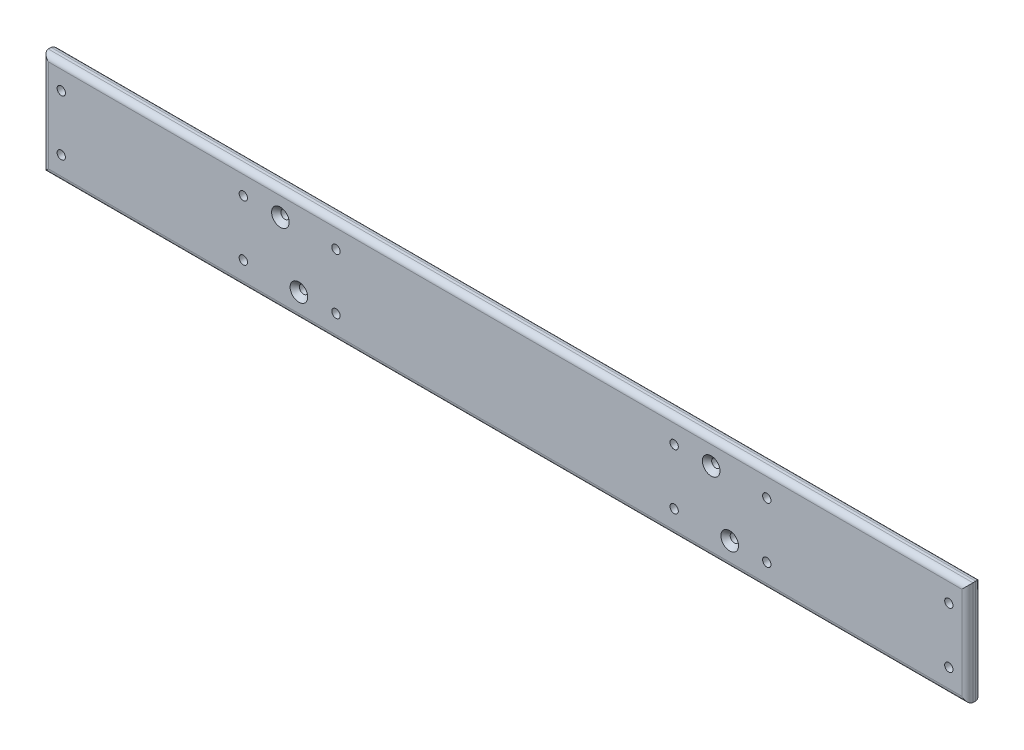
ISO-10303-21;
HEADER;
FILE_DESCRIPTION(('STEP AP214'),'2;1');
FILE_NAME('part.step','',(''),(''),'','','');
FILE_SCHEMA(('AUTOMOTIVE_DESIGN { 1 0 10303 214 1 1 1 1 }'));
ENDSEC;
DATA;
#1=APPLICATION_CONTEXT('core data for automotive mechanical design processes');
#2=APPLICATION_PROTOCOL_DEFINITION('international standard','automotive_design',2000,#1);
#3=PRODUCT_CONTEXT('',#1,'mechanical');
#4=PRODUCT('Part','Part','',(#3));
#5=PRODUCT_RELATED_PRODUCT_CATEGORY('part','',(#4));
#6=PRODUCT_DEFINITION_FORMATION('','',#4);
#7=PRODUCT_DEFINITION_CONTEXT('part definition',#1,'design');
#8=PRODUCT_DEFINITION('design','',#6,#7);
#9=PRODUCT_DEFINITION_SHAPE('','',#8);
#10=(LENGTH_UNIT() NAMED_UNIT(*) SI_UNIT(.MILLI.,.METRE.));
#11=(NAMED_UNIT(*) PLANE_ANGLE_UNIT() SI_UNIT($,.RADIAN.));
#12=(NAMED_UNIT(*) SI_UNIT($,.STERADIAN.) SOLID_ANGLE_UNIT());
#13=UNCERTAINTY_MEASURE_WITH_UNIT(LENGTH_MEASURE(1.E-05),#10,'distance_accuracy_value','');
#14=(GEOMETRIC_REPRESENTATION_CONTEXT(3) GLOBAL_UNCERTAINTY_ASSIGNED_CONTEXT((#13)) GLOBAL_UNIT_ASSIGNED_CONTEXT((#10,
#11,#12)) REPRESENTATION_CONTEXT('',''));
#15=CARTESIAN_POINT('',(0.,0.,0.));
#16=DIRECTION('',(0.,0.,1.));
#17=DIRECTION('',(1.,0.,0.));
#18=AXIS2_PLACEMENT_3D('',#15,#16,#17);
#19=CARTESIAN_POINT('',(501.,112.,0.));
#20=DIRECTION('',(0.,0.,1.));
#21=DIRECTION('',(1.,0.,0.));
#22=AXIS2_PLACEMENT_3D('',#19,#20,#21);
#23=PLANE('',#22);
#24=DIRECTION('',(0.,-1.,0.));
#25=VECTOR('',#24,1.);
#26=CARTESIAN_POINT('',(507.,112.,0.));
#27=LINE('',#26,#25);
#28=CARTESIAN_POINT('',(507.,5.99999999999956,0.));
#29=VERTEX_POINT('',#28);
#30=CARTESIAN_POINT('',(507.,106.,0.));
#31=VERTEX_POINT('',#30);
#32=EDGE_CURVE('E239',#29,#31,#27,.F.);
#33=ORIENTED_EDGE('',*,*,#32,.T.);
#34=DIRECTION('',(1.,0.,0.));
#35=VECTOR('',#34,1.);
#36=CARTESIAN_POINT('',(1499.,106.,0.));
#37=LINE('',#36,#35);
#38=CARTESIAN_POINT('',(1493.,106.,0.));
#39=VERTEX_POINT('',#38);
#40=EDGE_CURVE('E244',#31,#39,#37,.T.);
#41=ORIENTED_EDGE('',*,*,#40,.T.);
#42=DIRECTION('',(0.,1.,0.));
#43=VECTOR('',#42,1.);
#44=CARTESIAN_POINT('',(1493.,112.,0.));
#45=LINE('',#44,#43);
#46=CARTESIAN_POINT('',(1493.,5.99999999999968,0.));
#47=VERTEX_POINT('',#46);
#48=EDGE_CURVE('E241',#39,#47,#45,.F.);
#49=ORIENTED_EDGE('',*,*,#48,.T.);
#50=DIRECTION('',(-1.,0.,0.));
#51=VECTOR('',#50,1.);
#52=CARTESIAN_POINT('',(501.,5.99999999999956,0.));
#53=LINE('',#52,#51);
#54=EDGE_CURVE('E237',#47,#29,#53,.T.);
#55=ORIENTED_EDGE('',*,*,#54,.T.);
#56=EDGE_LOOP('',(#33,#41,#49,#55));
#57=FACE_BOUND('',#56,.T.);
#58=CARTESIAN_POINT('',(817.5,26.,0.));
#59=DIRECTION('',(0.,0.,1.));
#60=DIRECTION('',(1.,0.,0.));
#61=AXIS2_PLACEMENT_3D('',#58,#59,#60);
#62=CIRCLE('',#61,4.49999999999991);
#63=CARTESIAN_POINT('',(822.,26.,0.));
#64=VERTEX_POINT('',#63);
#65=EDGE_CURVE('E154',#64,#64,#62,.T.);
#66=ORIENTED_EDGE('',*,*,#65,.T.);
#67=EDGE_LOOP('',(#66));
#68=FACE_BOUND('',#67,.T.);
#69=CARTESIAN_POINT('',(1282.5,86.,0.));
#70=DIRECTION('',(0.,0.,1.));
#71=DIRECTION('',(1.,0.,0.));
#72=AXIS2_PLACEMENT_3D('',#69,#70,#71);
#73=CIRCLE('',#72,4.50000000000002);
#74=CARTESIAN_POINT('',(1287.,86.,0.));
#75=VERTEX_POINT('',#74);
#76=EDGE_CURVE('E166',#75,#75,#73,.T.);
#77=ORIENTED_EDGE('',*,*,#76,.T.);
#78=EDGE_LOOP('',(#77));
#79=FACE_BOUND('',#78,.T.);
#80=CARTESIAN_POINT('',(1182.5,26.,0.));
#81=DIRECTION('',(0.,0.,1.));
#82=DIRECTION('',(1.,0.,0.));
#83=AXIS2_PLACEMENT_3D('',#80,#81,#82);
#84=CIRCLE('',#83,4.50000000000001);
#85=CARTESIAN_POINT('',(1187.,26.,0.));
#86=VERTEX_POINT('',#85);
#87=EDGE_CURVE('E178',#86,#86,#84,.T.);
#88=ORIENTED_EDGE('',*,*,#87,.T.);
#89=EDGE_LOOP('',(#88));
#90=FACE_BOUND('',#89,.T.);
#91=CARTESIAN_POINT('',(1242.5,26.,0.));
#92=DIRECTION('',(0.,0.,1.));
#93=DIRECTION('',(1.,0.,0.));
#94=AXIS2_PLACEMENT_3D('',#91,#92,#93);
#95=CIRCLE('',#94,4.50000000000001);
#96=CARTESIAN_POINT('',(1247.,26.,0.));
#97=VERTEX_POINT('',#96);
#98=EDGE_CURVE('E190',#97,#97,#95,.T.);
#99=ORIENTED_EDGE('',*,*,#98,.T.);
#100=EDGE_LOOP('',(#99));
#101=FACE_BOUND('',#100,.T.);
#102=CARTESIAN_POINT('',(1479.,86.,0.));
#103=DIRECTION('',(0.,0.,1.));
#104=DIRECTION('',(1.,0.,0.));
#105=AXIS2_PLACEMENT_3D('',#102,#103,#104);
#106=CIRCLE('',#105,4.50000000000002);
#107=CARTESIAN_POINT('',(1483.5,86.,0.));
#108=VERTEX_POINT('',#107);
#109=EDGE_CURVE('E199',#108,#108,#106,.T.);
#110=ORIENTED_EDGE('',*,*,#109,.T.);
#111=EDGE_LOOP('',(#110));
#112=FACE_BOUND('',#111,.T.);
#113=CARTESIAN_POINT('',(521.,86.,0.));
#114=DIRECTION('',(0.,0.,1.));
#115=DIRECTION('',(1.,0.,0.));
#116=AXIS2_PLACEMENT_3D('',#113,#114,#115);
#117=CIRCLE('',#116,4.49999999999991);
#118=CARTESIAN_POINT('',(525.5,86.,0.));
#119=VERTEX_POINT('',#118);
#120=EDGE_CURVE('E211',#119,#119,#117,.T.);
#121=ORIENTED_EDGE('',*,*,#120,.T.);
#122=EDGE_LOOP('',(#121));
#123=FACE_BOUND('',#122,.T.);
#124=CARTESIAN_POINT('',(777.5,26.,0.));
#125=DIRECTION('',(0.,0.,1.));
#126=DIRECTION('',(1.,0.,0.));
#127=AXIS2_PLACEMENT_3D('',#124,#125,#126);
#128=CIRCLE('',#127,4.49999999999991);
#129=CARTESIAN_POINT('',(782.,26.,0.));
#130=VERTEX_POINT('',#129);
#131=EDGE_CURVE('E220',#130,#130,#128,.T.);
#132=ORIENTED_EDGE('',*,*,#131,.T.);
#133=EDGE_LOOP('',(#132));
#134=FACE_BOUND('',#133,.T.);
#135=CARTESIAN_POINT('',(717.5,86.0000000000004,0.));
#136=DIRECTION('',(0.,0.,1.));
#137=DIRECTION('',(1.,0.,0.));
#138=AXIS2_PLACEMENT_3D('',#135,#136,#137);
#139=CIRCLE('',#138,4.49999999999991);
#140=CARTESIAN_POINT('',(722.,86.0000000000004,0.));
#141=VERTEX_POINT('',#140);
#142=EDGE_CURVE('E226',#141,#141,#139,.T.);
#143=ORIENTED_EDGE('',*,*,#142,.T.);
#144=EDGE_LOOP('',(#143));
#145=FACE_BOUND('',#144,.T.);
#146=CARTESIAN_POINT('',(757.5,86.0000000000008,0.));
#147=DIRECTION('',(0.,0.,1.));
#148=DIRECTION('',(1.,0.,0.));
#149=AXIS2_PLACEMENT_3D('',#146,#147,#148);
#150=CIRCLE('',#149,4.49999999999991);
#151=CARTESIAN_POINT('',(762.,86.0000000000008,0.));
#152=VERTEX_POINT('',#151);
#153=EDGE_CURVE('E223',#152,#152,#150,.T.);
#154=ORIENTED_EDGE('',*,*,#153,.T.);
#155=EDGE_LOOP('',(#154));
#156=FACE_BOUND('',#155,.T.);
#157=CARTESIAN_POINT('',(1222.5,86.,0.));
#158=DIRECTION('',(0.,0.,1.));
#159=DIRECTION('',(1.,0.,0.));
#160=AXIS2_PLACEMENT_3D('',#157,#158,#159);
#161=CIRCLE('',#160,4.50000000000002);
#162=CARTESIAN_POINT('',(1227.,86.,0.));
#163=VERTEX_POINT('',#162);
#164=EDGE_CURVE('E217',#163,#163,#161,.T.);
#165=ORIENTED_EDGE('',*,*,#164,.T.);
#166=EDGE_LOOP('',(#165));
#167=FACE_BOUND('',#166,.T.);
#168=CARTESIAN_POINT('',(521.,26.,0.));
#169=DIRECTION('',(0.,0.,1.));
#170=DIRECTION('',(1.,0.,0.));
#171=AXIS2_PLACEMENT_3D('',#168,#169,#170);
#172=CIRCLE('',#171,4.49999999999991);
#173=CARTESIAN_POINT('',(525.5,26.,0.));
#174=VERTEX_POINT('',#173);
#175=EDGE_CURVE('E205',#174,#174,#172,.T.);
#176=ORIENTED_EDGE('',*,*,#175,.T.);
#177=EDGE_LOOP('',(#176));
#178=FACE_BOUND('',#177,.T.);
#179=CARTESIAN_POINT('',(1479.,26.,0.));
#180=DIRECTION('',(0.,0.,1.));
#181=DIRECTION('',(1.,0.,0.));
#182=AXIS2_PLACEMENT_3D('',#179,#180,#181);
#183=CIRCLE('',#182,4.50000000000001);
#184=CARTESIAN_POINT('',(1483.5,26.,0.));
#185=VERTEX_POINT('',#184);
#186=EDGE_CURVE('E193',#185,#185,#183,.T.);
#187=ORIENTED_EDGE('',*,*,#186,.T.);
#188=EDGE_LOOP('',(#187));
#189=FACE_BOUND('',#188,.T.);
#190=CARTESIAN_POINT('',(1182.5,86.,0.));
#191=DIRECTION('',(0.,0.,1.));
#192=DIRECTION('',(1.,0.,0.));
#193=AXIS2_PLACEMENT_3D('',#190,#191,#192);
#194=CIRCLE('',#193,4.50000000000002);
#195=CARTESIAN_POINT('',(1187.,86.,0.));
#196=VERTEX_POINT('',#195);
#197=EDGE_CURVE('E184',#196,#196,#194,.T.);
#198=ORIENTED_EDGE('',*,*,#197,.T.);
#199=EDGE_LOOP('',(#198));
#200=FACE_BOUND('',#199,.T.);
#201=CARTESIAN_POINT('',(1282.5,26.,0.));
#202=DIRECTION('',(0.,0.,1.));
#203=DIRECTION('',(1.,0.,0.));
#204=AXIS2_PLACEMENT_3D('',#201,#202,#203);
#205=CIRCLE('',#204,4.50000000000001);
#206=CARTESIAN_POINT('',(1287.,26.,0.));
#207=VERTEX_POINT('',#206);
#208=EDGE_CURVE('E172',#207,#207,#205,.T.);
#209=ORIENTED_EDGE('',*,*,#208,.T.);
#210=EDGE_LOOP('',(#209));
#211=FACE_BOUND('',#210,.T.);
#212=CARTESIAN_POINT('',(717.5,26.,0.));
#213=DIRECTION('',(0.,0.,1.));
#214=DIRECTION('',(1.,0.,0.));
#215=AXIS2_PLACEMENT_3D('',#212,#213,#214);
#216=CIRCLE('',#215,4.49999999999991);
#217=CARTESIAN_POINT('',(722.,26.,0.));
#218=VERTEX_POINT('',#217);
#219=EDGE_CURVE('E160',#218,#218,#216,.T.);
#220=ORIENTED_EDGE('',*,*,#219,.T.);
#221=EDGE_LOOP('',(#220));
#222=FACE_BOUND('',#221,.T.);
#223=CARTESIAN_POINT('',(817.5,86.,0.));
#224=DIRECTION('',(0.,0.,1.));
#225=DIRECTION('',(1.,0.,0.));
#226=AXIS2_PLACEMENT_3D('',#223,#224,#225);
#227=CIRCLE('',#226,4.49999999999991);
#228=CARTESIAN_POINT('',(822.,86.,0.));
#229=VERTEX_POINT('',#228);
#230=EDGE_CURVE('E148',#229,#229,#227,.T.);
#231=ORIENTED_EDGE('',*,*,#230,.T.);
#232=EDGE_LOOP('',(#231));
#233=FACE_BOUND('',#232,.T.);
#234=ADVANCED_FACE('F30',(#57,#68,#79,#90,#101,#112,#123,#134,#145,#156,#167,#178,#189,#200,
#211,#222,#233),#23,.F.);
#235=CARTESIAN_POINT('',(501.,112.,15.));
#236=DIRECTION('',(0.,0.,1.));
#237=DIRECTION('',(1.,0.,0.));
#238=AXIS2_PLACEMENT_3D('',#235,#236,#237);
#239=PLANE('',#238);
#240=CARTESIAN_POINT('',(1242.5,26.,15.));
#241=DIRECTION('',(0.,0.,1.));
#242=DIRECTION('',(1.,0.,0.));
#243=AXIS2_PLACEMENT_3D('',#240,#241,#242);
#244=CIRCLE('',#243,9.50000000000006);
#245=CARTESIAN_POINT('',(1252.,26.,15.));
#246=VERTEX_POINT('',#245);
#247=EDGE_CURVE('E273',#246,#246,#244,.F.);
#248=ORIENTED_EDGE('',*,*,#247,.T.);
#249=EDGE_LOOP('',(#248));
#250=FACE_BOUND('',#249,.T.);
#251=CARTESIAN_POINT('',(1222.5,86.,15.));
#252=DIRECTION('',(0.,0.,1.));
#253=DIRECTION('',(1.,0.,0.));
#254=AXIS2_PLACEMENT_3D('',#251,#252,#253);
#255=CIRCLE('',#254,9.50000000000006);
#256=CARTESIAN_POINT('',(1232.,86.,15.));
#257=VERTEX_POINT('',#256);
#258=EDGE_CURVE('E270',#257,#257,#255,.F.);
#259=ORIENTED_EDGE('',*,*,#258,.T.);
#260=EDGE_LOOP('',(#259));
#261=FACE_BOUND('',#260,.T.);
#262=CARTESIAN_POINT('',(777.5,26.,15.));
#263=DIRECTION('',(0.,0.,1.));
#264=DIRECTION('',(1.,0.,0.));
#265=AXIS2_PLACEMENT_3D('',#262,#263,#264);
#266=CIRCLE('',#265,9.49999999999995);
#267=CARTESIAN_POINT('',(787.,26.,15.));
#268=VERTEX_POINT('',#267);
#269=EDGE_CURVE('E267',#268,#268,#266,.F.);
#270=ORIENTED_EDGE('',*,*,#269,.T.);
#271=EDGE_LOOP('',(#270));
#272=FACE_BOUND('',#271,.T.);
#273=CARTESIAN_POINT('',(757.5,86.0000000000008,15.));
#274=DIRECTION('',(0.,0.,1.));
#275=DIRECTION('',(1.,0.,0.));
#276=AXIS2_PLACEMENT_3D('',#273,#274,#275);
#277=CIRCLE('',#276,9.49999999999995);
#278=CARTESIAN_POINT('',(767.,86.0000000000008,15.));
#279=VERTEX_POINT('',#278);
#280=EDGE_CURVE('E264',#279,#279,#277,.F.);
#281=ORIENTED_EDGE('',*,*,#280,.T.);
#282=EDGE_LOOP('',(#281));
#283=FACE_BOUND('',#282,.T.);
#284=DIRECTION('',(0.,1.,0.));
#285=VECTOR('',#284,1.);
#286=CARTESIAN_POINT('',(1493.,112.,15.));
#287=LINE('',#286,#285);
#288=CARTESIAN_POINT('',(1493.,5.99999999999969,15.));
#289=VERTEX_POINT('',#288);
#290=CARTESIAN_POINT('',(1493.,106.,15.));
#291=VERTEX_POINT('',#290);
#292=EDGE_CURVE('E250',#289,#291,#287,.T.);
#293=ORIENTED_EDGE('',*,*,#292,.T.);
#294=DIRECTION('',(1.,0.,0.));
#295=VECTOR('',#294,1.);
#296=CARTESIAN_POINT('',(501.,106.,15.));
#297=LINE('',#296,#295);
#298=CARTESIAN_POINT('',(507.,106.,15.));
#299=VERTEX_POINT('',#298);
#300=EDGE_CURVE('E128',#291,#299,#297,.F.);
#301=ORIENTED_EDGE('',*,*,#300,.T.);
#302=DIRECTION('',(0.,-1.,0.));
#303=VECTOR('',#302,1.);
#304=CARTESIAN_POINT('',(507.,-4.30211422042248E-13,15.));
#305=LINE('',#304,#303);
#306=CARTESIAN_POINT('',(507.,5.99999999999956,15.));
#307=VERTEX_POINT('',#306);
#308=EDGE_CURVE('E248',#299,#307,#305,.T.);
#309=ORIENTED_EDGE('',*,*,#308,.T.);
#310=DIRECTION('',(-1.,0.,0.));
#311=VECTOR('',#310,1.);
#312=CARTESIAN_POINT('',(501.,5.99999999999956,15.));
#313=LINE('',#312,#311);
#314=EDGE_CURVE('E246',#307,#289,#313,.F.);
#315=ORIENTED_EDGE('',*,*,#314,.T.);
#316=EDGE_LOOP('',(#293,#301,#309,#315));
#317=FACE_BOUND('',#316,.T.);
#318=CARTESIAN_POINT('',(817.5,26.,15.));
#319=DIRECTION('',(0.,0.,1.));
#320=DIRECTION('',(1.,0.,0.));
#321=AXIS2_PLACEMENT_3D('',#318,#319,#320);
#322=CIRCLE('',#321,4.49999999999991);
#323=CARTESIAN_POINT('',(822.,26.,15.));
#324=VERTEX_POINT('',#323);
#325=EDGE_CURVE('E157',#324,#324,#322,.T.);
#326=ORIENTED_EDGE('',*,*,#325,.F.);
#327=EDGE_LOOP('',(#326));
#328=FACE_BOUND('',#327,.T.);
#329=CARTESIAN_POINT('',(1282.5,86.,15.));
#330=DIRECTION('',(0.,0.,1.));
#331=DIRECTION('',(1.,0.,0.));
#332=AXIS2_PLACEMENT_3D('',#329,#330,#331);
#333=CIRCLE('',#332,4.50000000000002);
#334=CARTESIAN_POINT('',(1287.,86.,15.));
#335=VERTEX_POINT('',#334);
#336=EDGE_CURVE('E169',#335,#335,#333,.T.);
#337=ORIENTED_EDGE('',*,*,#336,.F.);
#338=EDGE_LOOP('',(#337));
#339=FACE_BOUND('',#338,.T.);
#340=CARTESIAN_POINT('',(1182.5,26.,15.));
#341=DIRECTION('',(0.,0.,1.));
#342=DIRECTION('',(1.,0.,0.));
#343=AXIS2_PLACEMENT_3D('',#340,#341,#342);
#344=CIRCLE('',#343,4.50000000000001);
#345=CARTESIAN_POINT('',(1187.,26.,15.));
#346=VERTEX_POINT('',#345);
#347=EDGE_CURVE('E181',#346,#346,#344,.T.);
#348=ORIENTED_EDGE('',*,*,#347,.F.);
#349=EDGE_LOOP('',(#348));
#350=FACE_BOUND('',#349,.T.);
#351=CARTESIAN_POINT('',(1479.,86.,15.));
#352=DIRECTION('',(0.,0.,1.));
#353=DIRECTION('',(1.,0.,0.));
#354=AXIS2_PLACEMENT_3D('',#351,#352,#353);
#355=CIRCLE('',#354,4.50000000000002);
#356=CARTESIAN_POINT('',(1483.5,86.,15.));
#357=VERTEX_POINT('',#356);
#358=EDGE_CURVE('E202',#357,#357,#355,.T.);
#359=ORIENTED_EDGE('',*,*,#358,.F.);
#360=EDGE_LOOP('',(#359));
#361=FACE_BOUND('',#360,.T.);
#362=CARTESIAN_POINT('',(521.,86.,15.));
#363=DIRECTION('',(0.,0.,1.));
#364=DIRECTION('',(1.,0.,0.));
#365=AXIS2_PLACEMENT_3D('',#362,#363,#364);
#366=CIRCLE('',#365,4.49999999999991);
#367=CARTESIAN_POINT('',(525.5,86.,15.));
#368=VERTEX_POINT('',#367);
#369=EDGE_CURVE('E214',#368,#368,#366,.T.);
#370=ORIENTED_EDGE('',*,*,#369,.F.);
#371=EDGE_LOOP('',(#370));
#372=FACE_BOUND('',#371,.T.);
#373=CARTESIAN_POINT('',(717.5,86.0000000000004,15.));
#374=DIRECTION('',(0.,0.,1.));
#375=DIRECTION('',(1.,0.,0.));
#376=AXIS2_PLACEMENT_3D('',#373,#374,#375);
#377=CIRCLE('',#376,4.49999999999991);
#378=CARTESIAN_POINT('',(722.,86.0000000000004,15.));
#379=VERTEX_POINT('',#378);
#380=EDGE_CURVE('E229',#379,#379,#377,.T.);
#381=ORIENTED_EDGE('',*,*,#380,.F.);
#382=EDGE_LOOP('',(#381));
#383=FACE_BOUND('',#382,.T.);
#384=CARTESIAN_POINT('',(521.,26.,15.));
#385=DIRECTION('',(0.,0.,1.));
#386=DIRECTION('',(1.,0.,0.));
#387=AXIS2_PLACEMENT_3D('',#384,#385,#386);
#388=CIRCLE('',#387,4.49999999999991);
#389=CARTESIAN_POINT('',(525.5,26.,15.));
#390=VERTEX_POINT('',#389);
#391=EDGE_CURVE('E208',#390,#390,#388,.T.);
#392=ORIENTED_EDGE('',*,*,#391,.F.);
#393=EDGE_LOOP('',(#392));
#394=FACE_BOUND('',#393,.T.);
#395=CARTESIAN_POINT('',(1479.,26.,15.));
#396=DIRECTION('',(0.,0.,1.));
#397=DIRECTION('',(1.,0.,0.));
#398=AXIS2_PLACEMENT_3D('',#395,#396,#397);
#399=CIRCLE('',#398,4.50000000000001);
#400=CARTESIAN_POINT('',(1483.5,26.,15.));
#401=VERTEX_POINT('',#400);
#402=EDGE_CURVE('E196',#401,#401,#399,.T.);
#403=ORIENTED_EDGE('',*,*,#402,.F.);
#404=EDGE_LOOP('',(#403));
#405=FACE_BOUND('',#404,.T.);
#406=CARTESIAN_POINT('',(1182.5,86.,15.));
#407=DIRECTION('',(0.,0.,1.));
#408=DIRECTION('',(1.,0.,0.));
#409=AXIS2_PLACEMENT_3D('',#406,#407,#408);
#410=CIRCLE('',#409,4.50000000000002);
#411=CARTESIAN_POINT('',(1187.,86.,15.));
#412=VERTEX_POINT('',#411);
#413=EDGE_CURVE('E187',#412,#412,#410,.T.);
#414=ORIENTED_EDGE('',*,*,#413,.F.);
#415=EDGE_LOOP('',(#414));
#416=FACE_BOUND('',#415,.T.);
#417=CARTESIAN_POINT('',(1282.5,26.,15.));
#418=DIRECTION('',(0.,0.,1.));
#419=DIRECTION('',(1.,0.,0.));
#420=AXIS2_PLACEMENT_3D('',#417,#418,#419);
#421=CIRCLE('',#420,4.50000000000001);
#422=CARTESIAN_POINT('',(1287.,26.,15.));
#423=VERTEX_POINT('',#422);
#424=EDGE_CURVE('E175',#423,#423,#421,.T.);
#425=ORIENTED_EDGE('',*,*,#424,.F.);
#426=EDGE_LOOP('',(#425));
#427=FACE_BOUND('',#426,.T.);
#428=CARTESIAN_POINT('',(717.5,26.,15.));
#429=DIRECTION('',(0.,0.,1.));
#430=DIRECTION('',(1.,0.,0.));
#431=AXIS2_PLACEMENT_3D('',#428,#429,#430);
#432=CIRCLE('',#431,4.49999999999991);
#433=CARTESIAN_POINT('',(722.,26.,15.));
#434=VERTEX_POINT('',#433);
#435=EDGE_CURVE('E163',#434,#434,#432,.T.);
#436=ORIENTED_EDGE('',*,*,#435,.F.);
#437=EDGE_LOOP('',(#436));
#438=FACE_BOUND('',#437,.T.);
#439=CARTESIAN_POINT('',(817.5,86.,15.));
#440=DIRECTION('',(0.,0.,1.));
#441=DIRECTION('',(1.,0.,0.));
#442=AXIS2_PLACEMENT_3D('',#439,#440,#441);
#443=CIRCLE('',#442,4.49999999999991);
#444=CARTESIAN_POINT('',(822.,86.,15.));
#445=VERTEX_POINT('',#444);
#446=EDGE_CURVE('E151',#445,#445,#443,.T.);
#447=ORIENTED_EDGE('',*,*,#446,.F.);
#448=EDGE_LOOP('',(#447));
#449=FACE_BOUND('',#448,.T.);
#450=ADVANCED_FACE('F301',(#250,#261,#272,#283,#317,#328,#339,#350,#361,#372,#383,#394,#405,
#416,#427,#438,#449),#239,.T.);
#451=CARTESIAN_POINT('',(501.,112.,15.));
#452=DIRECTION('',(1.,0.,0.));
#453=DIRECTION('',(0.,0.,-1.));
#454=AXIS2_PLACEMENT_3D('',#451,#452,#453);
#455=PLANE('',#454);
#456=DIRECTION('',(0.,0.,-1.));
#457=VECTOR('',#456,1.);
#458=CARTESIAN_POINT('',(501.,-4.35486174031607E-13,15.));
#459=LINE('',#458,#457);
#460=CARTESIAN_POINT('',(501.,-4.35486174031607E-13,9.));
#461=VERTEX_POINT('',#460);
#462=CARTESIAN_POINT('',(501.,-4.35486174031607E-13,6.));
#463=VERTEX_POINT('',#462);
#464=EDGE_CURVE('E125',#461,#463,#459,.T.);
#465=ORIENTED_EDGE('',*,*,#464,.F.);
#466=DIRECTION('',(0.,-1.,0.));
#467=VECTOR('',#466,1.);
#468=CARTESIAN_POINT('',(501.,112.,9.));
#469=LINE('',#468,#467);
#470=CARTESIAN_POINT('',(501.,112.,9.));
#471=VERTEX_POINT('',#470);
#472=EDGE_CURVE('E52',#461,#471,#469,.F.);
#473=ORIENTED_EDGE('',*,*,#472,.T.);
#474=DIRECTION('',(0.,0.,-1.));
#475=VECTOR('',#474,1.);
#476=CARTESIAN_POINT('',(501.,112.,15.));
#477=LINE('',#476,#475);
#478=CARTESIAN_POINT('',(501.,112.,6.));
#479=VERTEX_POINT('',#478);
#480=EDGE_CURVE('E99',#471,#479,#477,.T.);
#481=ORIENTED_EDGE('',*,*,#480,.T.);
#482=DIRECTION('',(0.,-1.,0.));
#483=VECTOR('',#482,1.);
#484=CARTESIAN_POINT('',(501.,112.,6.));
#485=LINE('',#484,#483);
#486=EDGE_CURVE('E253',#479,#463,#485,.T.);
#487=ORIENTED_EDGE('',*,*,#486,.T.);
#488=EDGE_LOOP('',(#465,#473,#481,#487));
#489=FACE_BOUND('',#488,.T.);
#490=ADVANCED_FACE('F32',(#489),#455,.F.);
#491=CARTESIAN_POINT('',(1499.,-3.12250225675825E-13,15.));
#492=DIRECTION('',(0.,-1.,0.));
#493=DIRECTION('',(1.,0.,0.));
#494=AXIS2_PLACEMENT_3D('',#491,#492,#493);
#495=PLANE('',#494);
#496=ORIENTED_EDGE('',*,*,#464,.T.);
#497=DIRECTION('',(-1.,0.,0.));
#498=VECTOR('',#497,1.);
#499=CARTESIAN_POINT('',(1499.,-3.12250225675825E-13,6.));
#500=LINE('',#499,#498);
#501=CARTESIAN_POINT('',(1499.,-3.12250225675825E-13,6.));
#502=VERTEX_POINT('',#501);
#503=EDGE_CURVE('E259',#463,#502,#500,.F.);
#504=ORIENTED_EDGE('',*,*,#503,.T.);
#505=DIRECTION('',(0.,0.,-1.));
#506=VECTOR('',#505,1.);
#507=CARTESIAN_POINT('',(1499.,-3.12250225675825E-13,15.));
#508=LINE('',#507,#506);
#509=CARTESIAN_POINT('',(1499.,-3.12250225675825E-13,9.));
#510=VERTEX_POINT('',#509);
#511=EDGE_CURVE('E115',#510,#502,#508,.T.);
#512=ORIENTED_EDGE('',*,*,#511,.F.);
#513=DIRECTION('',(-1.,0.,0.));
#514=VECTOR('',#513,1.);
#515=CARTESIAN_POINT('',(1499.,-3.12250225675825E-13,9.));
#516=LINE('',#515,#514);
#517=EDGE_CURVE('E257',#510,#461,#516,.T.);
#518=ORIENTED_EDGE('',*,*,#517,.T.);
#519=EDGE_LOOP('',(#496,#504,#512,#518));
#520=FACE_BOUND('',#519,.T.);
#521=ADVANCED_FACE('F317',(#520),#495,.T.);
#522=CARTESIAN_POINT('',(1499.,-3.12250225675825E-13,15.));
#523=DIRECTION('',(-1.,0.,0.));
#524=DIRECTION('',(0.,0.,1.));
#525=AXIS2_PLACEMENT_3D('',#522,#523,#524);
#526=PLANE('',#525);
#527=ORIENTED_EDGE('',*,*,#511,.T.);
#528=DIRECTION('',(0.,1.,0.));
#529=VECTOR('',#528,1.);
#530=CARTESIAN_POINT('',(1499.,-3.12250225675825E-13,6.));
#531=LINE('',#530,#529);
#532=CARTESIAN_POINT('',(1499.,112.,6.));
#533=VERTEX_POINT('',#532);
#534=EDGE_CURVE('E114',#502,#533,#531,.T.);
#535=ORIENTED_EDGE('',*,*,#534,.T.);
#536=DIRECTION('',(0.,0.,-1.));
#537=VECTOR('',#536,1.);
#538=CARTESIAN_POINT('',(1499.,112.,15.));
#539=LINE('',#538,#537);
#540=CARTESIAN_POINT('',(1499.,112.,9.));
#541=VERTEX_POINT('',#540);
#542=EDGE_CURVE('E98',#541,#533,#539,.T.);
#543=ORIENTED_EDGE('',*,*,#542,.F.);
#544=DIRECTION('',(0.,1.,0.));
#545=VECTOR('',#544,1.);
#546=CARTESIAN_POINT('',(1499.,-3.05311331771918E-13,9.));
#547=LINE('',#546,#545);
#548=EDGE_CURVE('E111',#541,#510,#547,.F.);
#549=ORIENTED_EDGE('',*,*,#548,.T.);
#550=EDGE_LOOP('',(#527,#535,#543,#549));
#551=FACE_BOUND('',#550,.T.);
#552=ADVANCED_FACE('F110',(#551),#526,.F.);
#553=CARTESIAN_POINT('',(501.,112.,15.));
#554=DIRECTION('',(0.,1.,0.));
#555=DIRECTION('',(0.,0.,1.));
#556=AXIS2_PLACEMENT_3D('',#553,#554,#555);
#557=PLANE('',#556);
#558=ORIENTED_EDGE('',*,*,#542,.T.);
#559=DIRECTION('',(1.,0.,0.));
#560=VECTOR('',#559,1.);
#561=CARTESIAN_POINT('',(501.,112.,6.));
#562=LINE('',#561,#560);
#563=EDGE_CURVE('E45',#533,#479,#562,.F.);
#564=ORIENTED_EDGE('',*,*,#563,.T.);
#565=ORIENTED_EDGE('',*,*,#480,.F.);
#566=DIRECTION('',(1.,0.,0.));
#567=VECTOR('',#566,1.);
#568=CARTESIAN_POINT('',(501.,112.,9.));
#569=LINE('',#568,#567);
#570=EDGE_CURVE('E95',#471,#541,#569,.T.);
#571=ORIENTED_EDGE('',*,*,#570,.T.);
#572=EDGE_LOOP('',(#558,#564,#565,#571));
#573=FACE_BOUND('',#572,.T.);
#574=ADVANCED_FACE('F97',(#573),#557,.T.);
#575=CARTESIAN_POINT('',(717.5,86.0000000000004,15.));
#576=DIRECTION('',(0.,0.,-1.));
#577=DIRECTION('',(-1.,0.,0.));
#578=AXIS2_PLACEMENT_3D('',#575,#576,#577);
#579=CYLINDRICAL_SURFACE('',#578,4.49999999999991);
#580=ORIENTED_EDGE('',*,*,#380,.T.);
#581=EDGE_LOOP('',(#580));
#582=FACE_BOUND('',#581,.T.);
#583=ORIENTED_EDGE('',*,*,#142,.F.);
#584=EDGE_LOOP('',(#583));
#585=FACE_BOUND('',#584,.T.);
#586=ADVANCED_FACE('F311',(#582,#585),#579,.F.);
#587=CARTESIAN_POINT('',(757.5,86.0000000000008,15.));
#588=DIRECTION('',(0.,0.,-1.));
#589=DIRECTION('',(-1.,0.,0.));
#590=AXIS2_PLACEMENT_3D('',#587,#588,#589);
#591=CYLINDRICAL_SURFACE('',#590,4.49999999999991);
#592=CARTESIAN_POINT('',(757.5,86.0000000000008,9.99999999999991));
#593=DIRECTION('',(0.,0.,1.));
#594=DIRECTION('',(1.,0.,0.));
#595=AXIS2_PLACEMENT_3D('',#592,#593,#594);
#596=CIRCLE('',#595,4.49999999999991);
#597=CARTESIAN_POINT('',(762.,86.0000000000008,9.99999999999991));
#598=VERTEX_POINT('',#597);
#599=EDGE_CURVE('E11',#598,#598,#596,.T.);
#600=ORIENTED_EDGE('',*,*,#599,.T.);
#601=EDGE_LOOP('',(#600));
#602=FACE_BOUND('',#601,.T.);
#603=ORIENTED_EDGE('',*,*,#153,.F.);
#604=EDGE_LOOP('',(#603));
#605=FACE_BOUND('',#604,.T.);
#606=ADVANCED_FACE('F407',(#602,#605),#591,.F.);
#607=CARTESIAN_POINT('',(777.5,26.,15.));
#608=DIRECTION('',(0.,0.,-1.));
#609=DIRECTION('',(-1.,0.,0.));
#610=AXIS2_PLACEMENT_3D('',#607,#608,#609);
#611=CYLINDRICAL_SURFACE('',#610,4.49999999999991);
#612=CARTESIAN_POINT('',(777.5,26.,9.99999999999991));
#613=DIRECTION('',(0.,0.,1.));
#614=DIRECTION('',(1.,0.,0.));
#615=AXIS2_PLACEMENT_3D('',#612,#613,#614);
#616=CIRCLE('',#615,4.49999999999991);
#617=CARTESIAN_POINT('',(782.,26.,9.99999999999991));
#618=VERTEX_POINT('',#617);
#619=EDGE_CURVE('E38',#618,#618,#616,.T.);
#620=ORIENTED_EDGE('',*,*,#619,.T.);
#621=EDGE_LOOP('',(#620));
#622=FACE_BOUND('',#621,.T.);
#623=ORIENTED_EDGE('',*,*,#131,.F.);
#624=EDGE_LOOP('',(#623));
#625=FACE_BOUND('',#624,.T.);
#626=ADVANCED_FACE('F281',(#622,#625),#611,.F.);
#627=CARTESIAN_POINT('',(1222.5,86.,15.));
#628=DIRECTION('',(0.,0.,-1.));
#629=DIRECTION('',(-1.,0.,0.));
#630=AXIS2_PLACEMENT_3D('',#627,#628,#629);
#631=CYLINDRICAL_SURFACE('',#630,4.50000000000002);
#632=CARTESIAN_POINT('',(1222.5,86.,9.99999999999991));
#633=DIRECTION('',(0.,0.,1.));
#634=DIRECTION('',(1.,0.,0.));
#635=AXIS2_PLACEMENT_3D('',#632,#633,#634);
#636=CIRCLE('',#635,4.50000000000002);
#637=CARTESIAN_POINT('',(1227.,86.,9.99999999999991));
#638=VERTEX_POINT('',#637);
#639=EDGE_CURVE('E276',#638,#638,#636,.T.);
#640=ORIENTED_EDGE('',*,*,#639,.T.);
#641=EDGE_LOOP('',(#640));
#642=FACE_BOUND('',#641,.T.);
#643=ORIENTED_EDGE('',*,*,#164,.F.);
#644=EDGE_LOOP('',(#643));
#645=FACE_BOUND('',#644,.T.);
#646=ADVANCED_FACE('F401',(#642,#645),#631,.F.);
#647=CARTESIAN_POINT('',(521.,86.,15.));
#648=DIRECTION('',(0.,0.,-1.));
#649=DIRECTION('',(-1.,0.,0.));
#650=AXIS2_PLACEMENT_3D('',#647,#648,#649);
#651=CYLINDRICAL_SURFACE('',#650,4.49999999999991);
#652=ORIENTED_EDGE('',*,*,#369,.T.);
#653=EDGE_LOOP('',(#652));
#654=FACE_BOUND('',#653,.T.);
#655=ORIENTED_EDGE('',*,*,#120,.F.);
#656=EDGE_LOOP('',(#655));
#657=FACE_BOUND('',#656,.T.);
#658=ADVANCED_FACE('F397',(#654,#657),#651,.F.);
#659=CARTESIAN_POINT('',(521.,26.,15.));
#660=DIRECTION('',(0.,0.,-1.));
#661=DIRECTION('',(-1.,0.,0.));
#662=AXIS2_PLACEMENT_3D('',#659,#660,#661);
#663=CYLINDRICAL_SURFACE('',#662,4.49999999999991);
#664=ORIENTED_EDGE('',*,*,#391,.T.);
#665=EDGE_LOOP('',(#664));
#666=FACE_BOUND('',#665,.T.);
#667=ORIENTED_EDGE('',*,*,#175,.F.);
#668=EDGE_LOOP('',(#667));
#669=FACE_BOUND('',#668,.T.);
#670=ADVANCED_FACE('F393',(#666,#669),#663,.F.);
#671=CARTESIAN_POINT('',(1479.,86.,15.));
#672=DIRECTION('',(0.,0.,-1.));
#673=DIRECTION('',(-1.,0.,0.));
#674=AXIS2_PLACEMENT_3D('',#671,#672,#673);
#675=CYLINDRICAL_SURFACE('',#674,4.50000000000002);
#676=ORIENTED_EDGE('',*,*,#358,.T.);
#677=EDGE_LOOP('',(#676));
#678=FACE_BOUND('',#677,.T.);
#679=ORIENTED_EDGE('',*,*,#109,.F.);
#680=EDGE_LOOP('',(#679));
#681=FACE_BOUND('',#680,.T.);
#682=ADVANCED_FACE('F389',(#678,#681),#675,.F.);
#683=CARTESIAN_POINT('',(1479.,26.,15.));
#684=DIRECTION('',(0.,0.,-1.));
#685=DIRECTION('',(-1.,0.,0.));
#686=AXIS2_PLACEMENT_3D('',#683,#684,#685);
#687=CYLINDRICAL_SURFACE('',#686,4.50000000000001);
#688=ORIENTED_EDGE('',*,*,#402,.T.);
#689=EDGE_LOOP('',(#688));
#690=FACE_BOUND('',#689,.T.);
#691=ORIENTED_EDGE('',*,*,#186,.F.);
#692=EDGE_LOOP('',(#691));
#693=FACE_BOUND('',#692,.T.);
#694=ADVANCED_FACE('F385',(#690,#693),#687,.F.);
#695=CARTESIAN_POINT('',(1242.5,26.,15.));
#696=DIRECTION('',(0.,0.,-1.));
#697=DIRECTION('',(-1.,0.,0.));
#698=AXIS2_PLACEMENT_3D('',#695,#696,#697);
#699=CYLINDRICAL_SURFACE('',#698,4.50000000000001);
#700=CARTESIAN_POINT('',(1242.5,26.,9.99999999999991));
#701=DIRECTION('',(0.,0.,1.));
#702=DIRECTION('',(1.,0.,0.));
#703=AXIS2_PLACEMENT_3D('',#700,#701,#702);
#704=CIRCLE('',#703,4.50000000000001);
#705=CARTESIAN_POINT('',(1247.,26.,9.99999999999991));
#706=VERTEX_POINT('',#705);
#707=EDGE_CURVE('E261',#706,#706,#704,.T.);
#708=ORIENTED_EDGE('',*,*,#707,.T.);
#709=EDGE_LOOP('',(#708));
#710=FACE_BOUND('',#709,.T.);
#711=ORIENTED_EDGE('',*,*,#98,.F.);
#712=EDGE_LOOP('',(#711));
#713=FACE_BOUND('',#712,.T.);
#714=ADVANCED_FACE('F381',(#710,#713),#699,.F.);
#715=CARTESIAN_POINT('',(1182.5,86.,15.));
#716=DIRECTION('',(0.,0.,-1.));
#717=DIRECTION('',(-1.,0.,0.));
#718=AXIS2_PLACEMENT_3D('',#715,#716,#717);
#719=CYLINDRICAL_SURFACE('',#718,4.50000000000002);
#720=ORIENTED_EDGE('',*,*,#413,.T.);
#721=EDGE_LOOP('',(#720));
#722=FACE_BOUND('',#721,.T.);
#723=ORIENTED_EDGE('',*,*,#197,.F.);
#724=EDGE_LOOP('',(#723));
#725=FACE_BOUND('',#724,.T.);
#726=ADVANCED_FACE('F377',(#722,#725),#719,.F.);
#727=CARTESIAN_POINT('',(1182.5,26.,15.));
#728=DIRECTION('',(0.,0.,-1.));
#729=DIRECTION('',(-1.,0.,0.));
#730=AXIS2_PLACEMENT_3D('',#727,#728,#729);
#731=CYLINDRICAL_SURFACE('',#730,4.50000000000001);
#732=ORIENTED_EDGE('',*,*,#347,.T.);
#733=EDGE_LOOP('',(#732));
#734=FACE_BOUND('',#733,.T.);
#735=ORIENTED_EDGE('',*,*,#87,.F.);
#736=EDGE_LOOP('',(#735));
#737=FACE_BOUND('',#736,.T.);
#738=ADVANCED_FACE('F373',(#734,#737),#731,.F.);
#739=CARTESIAN_POINT('',(1282.5,26.,15.));
#740=DIRECTION('',(0.,0.,-1.));
#741=DIRECTION('',(-1.,0.,0.));
#742=AXIS2_PLACEMENT_3D('',#739,#740,#741);
#743=CYLINDRICAL_SURFACE('',#742,4.50000000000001);
#744=ORIENTED_EDGE('',*,*,#424,.T.);
#745=EDGE_LOOP('',(#744));
#746=FACE_BOUND('',#745,.T.);
#747=ORIENTED_EDGE('',*,*,#208,.F.);
#748=EDGE_LOOP('',(#747));
#749=FACE_BOUND('',#748,.T.);
#750=ADVANCED_FACE('F369',(#746,#749),#743,.F.);
#751=CARTESIAN_POINT('',(1282.5,86.,15.));
#752=DIRECTION('',(0.,0.,-1.));
#753=DIRECTION('',(-1.,0.,0.));
#754=AXIS2_PLACEMENT_3D('',#751,#752,#753);
#755=CYLINDRICAL_SURFACE('',#754,4.50000000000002);
#756=ORIENTED_EDGE('',*,*,#336,.T.);
#757=EDGE_LOOP('',(#756));
#758=FACE_BOUND('',#757,.T.);
#759=ORIENTED_EDGE('',*,*,#76,.F.);
#760=EDGE_LOOP('',(#759));
#761=FACE_BOUND('',#760,.T.);
#762=ADVANCED_FACE('F365',(#758,#761),#755,.F.);
#763=CARTESIAN_POINT('',(717.5,26.,15.));
#764=DIRECTION('',(0.,0.,-1.));
#765=DIRECTION('',(-1.,0.,0.));
#766=AXIS2_PLACEMENT_3D('',#763,#764,#765);
#767=CYLINDRICAL_SURFACE('',#766,4.49999999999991);
#768=ORIENTED_EDGE('',*,*,#435,.T.);
#769=EDGE_LOOP('',(#768));
#770=FACE_BOUND('',#769,.T.);
#771=ORIENTED_EDGE('',*,*,#219,.F.);
#772=EDGE_LOOP('',(#771));
#773=FACE_BOUND('',#772,.T.);
#774=ADVANCED_FACE('F361',(#770,#773),#767,.F.);
#775=CARTESIAN_POINT('',(817.5,26.,15.));
#776=DIRECTION('',(0.,0.,-1.));
#777=DIRECTION('',(-1.,0.,0.));
#778=AXIS2_PLACEMENT_3D('',#775,#776,#777);
#779=CYLINDRICAL_SURFACE('',#778,4.49999999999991);
#780=ORIENTED_EDGE('',*,*,#325,.T.);
#781=EDGE_LOOP('',(#780));
#782=FACE_BOUND('',#781,.T.);
#783=ORIENTED_EDGE('',*,*,#65,.F.);
#784=EDGE_LOOP('',(#783));
#785=FACE_BOUND('',#784,.T.);
#786=ADVANCED_FACE('F357',(#782,#785),#779,.F.);
#787=CARTESIAN_POINT('',(817.5,86.,15.));
#788=DIRECTION('',(0.,0.,-1.));
#789=DIRECTION('',(-1.,0.,0.));
#790=AXIS2_PLACEMENT_3D('',#787,#788,#789);
#791=CYLINDRICAL_SURFACE('',#790,4.49999999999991);
#792=ORIENTED_EDGE('',*,*,#446,.T.);
#793=EDGE_LOOP('',(#792));
#794=FACE_BOUND('',#793,.T.);
#795=ORIENTED_EDGE('',*,*,#230,.F.);
#796=EDGE_LOOP('',(#795));
#797=FACE_BOUND('',#796,.T.);
#798=ADVANCED_FACE('F354',(#794,#797),#791,.F.);
#799=CARTESIAN_POINT('',(507.,112.,6.));
#800=DIRECTION('',(0.,-1.,0.));
#801=DIRECTION('',(0.,0.,-1.));
#802=AXIS2_PLACEMENT_3D('',#799,#800,#801);
#803=CYLINDRICAL_SURFACE('',#802,6.);
#804=CARTESIAN_POINT('',(507.,106.,6.));
#805=DIRECTION('',(-0.707106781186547,-0.707106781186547,0.));
#806=DIRECTION('',(-0.707106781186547,0.707106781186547,0.));
#807=AXIS2_PLACEMENT_3D('',#804,#805,#806);
#808=ELLIPSE('',#807,8.48528137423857,6.);
#809=EDGE_CURVE('E142',#31,#479,#808,.F.);
#810=ORIENTED_EDGE('',*,*,#809,.F.);
#811=ORIENTED_EDGE('',*,*,#32,.F.);
#812=CARTESIAN_POINT('',(507.,5.99999999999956,6.));
#813=DIRECTION('',(0.707106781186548,-0.707106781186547,0.));
#814=DIRECTION('',(0.707106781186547,0.707106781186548,0.));
#815=AXIS2_PLACEMENT_3D('',#812,#813,#814);
#816=ELLIPSE('',#815,8.48528137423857,6.);
#817=EDGE_CURVE('E145',#463,#29,#816,.T.);
#818=ORIENTED_EDGE('',*,*,#817,.F.);
#819=ORIENTED_EDGE('',*,*,#486,.F.);
#820=EDGE_LOOP('',(#810,#811,#818,#819));
#821=FACE_BOUND('',#820,.T.);
#822=ADVANCED_FACE('F329',(#821),#803,.T.);
#823=CARTESIAN_POINT('',(501.,5.99999999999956,6.));
#824=DIRECTION('',(1.,0.,0.));
#825=DIRECTION('',(0.,1.,0.));
#826=AXIS2_PLACEMENT_3D('',#823,#824,#825);
#827=CYLINDRICAL_SURFACE('',#826,6.);
#828=ORIENTED_EDGE('',*,*,#817,.T.);
#829=ORIENTED_EDGE('',*,*,#54,.F.);
#830=CARTESIAN_POINT('',(1493.,5.99999999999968,6.));
#831=DIRECTION('',(0.707106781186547,0.707106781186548,0.));
#832=DIRECTION('',(0.707106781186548,-0.707106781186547,0.));
#833=AXIS2_PLACEMENT_3D('',#830,#831,#832);
#834=ELLIPSE('',#833,8.48528137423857,6.);
#835=EDGE_CURVE('E140',#502,#47,#834,.T.);
#836=ORIENTED_EDGE('',*,*,#835,.F.);
#837=ORIENTED_EDGE('',*,*,#503,.F.);
#838=EDGE_LOOP('',(#828,#829,#836,#837));
#839=FACE_BOUND('',#838,.T.);
#840=ADVANCED_FACE('F333',(#839),#827,.T.);
#841=CARTESIAN_POINT('',(501.,106.,6.));
#842=DIRECTION('',(-1.,0.,0.));
#843=DIRECTION('',(0.,0.,1.));
#844=AXIS2_PLACEMENT_3D('',#841,#842,#843);
#845=CYLINDRICAL_SURFACE('',#844,6.);
#846=ORIENTED_EDGE('',*,*,#809,.T.);
#847=ORIENTED_EDGE('',*,*,#563,.F.);
#848=CARTESIAN_POINT('',(1493.,106.,6.));
#849=DIRECTION('',(-0.707106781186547,0.707106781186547,0.));
#850=DIRECTION('',(-0.707106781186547,-0.707106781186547,0.));
#851=AXIS2_PLACEMENT_3D('',#848,#849,#850);
#852=ELLIPSE('',#851,8.48528137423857,6.);
#853=EDGE_CURVE('E138',#39,#533,#852,.F.);
#854=ORIENTED_EDGE('',*,*,#853,.F.);
#855=ORIENTED_EDGE('',*,*,#40,.F.);
#856=EDGE_LOOP('',(#846,#847,#854,#855));
#857=FACE_BOUND('',#856,.T.);
#858=ADVANCED_FACE('F340',(#857),#845,.T.);
#859=CARTESIAN_POINT('',(1493.,-3.12250225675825E-13,6.));
#860=DIRECTION('',(0.,1.,0.));
#861=DIRECTION('',(0.,0.,1.));
#862=AXIS2_PLACEMENT_3D('',#859,#860,#861);
#863=CYLINDRICAL_SURFACE('',#862,6.);
#864=ORIENTED_EDGE('',*,*,#835,.T.);
#865=ORIENTED_EDGE('',*,*,#48,.F.);
#866=ORIENTED_EDGE('',*,*,#853,.T.);
#867=ORIENTED_EDGE('',*,*,#534,.F.);
#868=EDGE_LOOP('',(#864,#865,#866,#867));
#869=FACE_BOUND('',#868,.T.);
#870=ADVANCED_FACE('F336',(#869),#863,.T.);
#871=CARTESIAN_POINT('',(507.,112.,9.));
#872=DIRECTION('',(0.,1.,0.));
#873=DIRECTION('',(0.,0.,1.));
#874=AXIS2_PLACEMENT_3D('',#871,#872,#873);
#875=CYLINDRICAL_SURFACE('',#874,6.);
#876=CARTESIAN_POINT('',(507.,106.,9.));
#877=DIRECTION('',(0.707106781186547,0.707106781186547,0.));
#878=DIRECTION('',(0.707106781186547,-0.707106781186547,0.));
#879=AXIS2_PLACEMENT_3D('',#876,#877,#878);
#880=ELLIPSE('',#879,8.48528137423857,6.);
#881=EDGE_CURVE('E131',#471,#299,#880,.T.);
#882=ORIENTED_EDGE('',*,*,#881,.F.);
#883=ORIENTED_EDGE('',*,*,#472,.F.);
#884=CARTESIAN_POINT('',(507.,5.99999999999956,9.));
#885=DIRECTION('',(-0.707106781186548,0.707106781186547,0.));
#886=DIRECTION('',(-0.707106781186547,-0.707106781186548,0.));
#887=AXIS2_PLACEMENT_3D('',#884,#885,#886);
#888=ELLIPSE('',#887,8.48528137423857,6.);
#889=EDGE_CURVE('E135',#307,#461,#888,.F.);
#890=ORIENTED_EDGE('',*,*,#889,.F.);
#891=ORIENTED_EDGE('',*,*,#308,.F.);
#892=EDGE_LOOP('',(#882,#883,#890,#891));
#893=FACE_BOUND('',#892,.T.);
#894=ADVANCED_FACE('F347',(#893),#875,.T.);
#895=CARTESIAN_POINT('',(1499.,5.99999999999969,9.));
#896=DIRECTION('',(-1.,0.,0.));
#897=DIRECTION('',(0.,-1.,0.));
#898=AXIS2_PLACEMENT_3D('',#895,#896,#897);
#899=CYLINDRICAL_SURFACE('',#898,6.);
#900=ORIENTED_EDGE('',*,*,#889,.T.);
#901=ORIENTED_EDGE('',*,*,#517,.F.);
#902=CARTESIAN_POINT('',(1493.,5.99999999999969,9.));
#903=DIRECTION('',(-0.707106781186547,-0.707106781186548,0.));
#904=DIRECTION('',(-0.707106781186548,0.707106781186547,0.));
#905=AXIS2_PLACEMENT_3D('',#902,#903,#904);
#906=ELLIPSE('',#905,8.48528137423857,6.);
#907=EDGE_CURVE('E123',#289,#510,#906,.F.);
#908=ORIENTED_EDGE('',*,*,#907,.F.);
#909=ORIENTED_EDGE('',*,*,#314,.F.);
#910=EDGE_LOOP('',(#900,#901,#908,#909));
#911=FACE_BOUND('',#910,.T.);
#912=ADVANCED_FACE('F592',(#911),#899,.T.);
#913=CARTESIAN_POINT('',(501.,106.,9.));
#914=DIRECTION('',(1.,0.,0.));
#915=DIRECTION('',(0.,0.,-1.));
#916=AXIS2_PLACEMENT_3D('',#913,#914,#915);
#917=CYLINDRICAL_SURFACE('',#916,6.);
#918=ORIENTED_EDGE('',*,*,#881,.T.);
#919=ORIENTED_EDGE('',*,*,#300,.F.);
#920=CARTESIAN_POINT('',(1493.,106.,9.));
#921=DIRECTION('',(0.707106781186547,-0.707106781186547,0.));
#922=DIRECTION('',(0.707106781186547,0.707106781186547,0.));
#923=AXIS2_PLACEMENT_3D('',#920,#921,#922);
#924=ELLIPSE('',#923,8.48528137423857,6.);
#925=EDGE_CURVE('E120',#541,#291,#924,.T.);
#926=ORIENTED_EDGE('',*,*,#925,.F.);
#927=ORIENTED_EDGE('',*,*,#570,.F.);
#928=EDGE_LOOP('',(#918,#919,#926,#927));
#929=FACE_BOUND('',#928,.T.);
#930=ADVANCED_FACE('F127',(#929),#917,.T.);
#931=CARTESIAN_POINT('',(1493.,112.,9.));
#932=DIRECTION('',(0.,-1.,0.));
#933=DIRECTION('',(0.,0.,-1.));
#934=AXIS2_PLACEMENT_3D('',#931,#932,#933);
#935=CYLINDRICAL_SURFACE('',#934,6.);
#936=ORIENTED_EDGE('',*,*,#907,.T.);
#937=ORIENTED_EDGE('',*,*,#548,.F.);
#938=ORIENTED_EDGE('',*,*,#925,.T.);
#939=ORIENTED_EDGE('',*,*,#292,.F.);
#940=EDGE_LOOP('',(#936,#937,#938,#939));
#941=FACE_BOUND('',#940,.T.);
#942=ADVANCED_FACE('F118',(#941),#935,.T.);
#943=CARTESIAN_POINT('',(1242.5,26.,9.99999999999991));
#944=DIRECTION('',(0.,0.,1.));
#945=DIRECTION('',(1.,0.,0.));
#946=AXIS2_PLACEMENT_3D('',#943,#944,#945);
#947=CONICAL_SURFACE('',#946,4.50000000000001,0.785398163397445);
#948=ORIENTED_EDGE('',*,*,#247,.F.);
#949=EDGE_LOOP('',(#948));
#950=FACE_BOUND('',#949,.T.);
#951=ORIENTED_EDGE('',*,*,#707,.F.);
#952=EDGE_LOOP('',(#951));
#953=FACE_BOUND('',#952,.T.);
#954=ADVANCED_FACE('F296',(#950,#953),#947,.F.);
#955=CARTESIAN_POINT('',(1222.5,86.,9.99999999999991));
#956=DIRECTION('',(0.,0.,1.));
#957=DIRECTION('',(1.,0.,0.));
#958=AXIS2_PLACEMENT_3D('',#955,#956,#957);
#959=CONICAL_SURFACE('',#958,4.50000000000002,0.785398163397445);
#960=ORIENTED_EDGE('',*,*,#258,.F.);
#961=EDGE_LOOP('',(#960));
#962=FACE_BOUND('',#961,.T.);
#963=ORIENTED_EDGE('',*,*,#639,.F.);
#964=EDGE_LOOP('',(#963));
#965=FACE_BOUND('',#964,.T.);
#966=ADVANCED_FACE('F287',(#962,#965),#959,.F.);
#967=CARTESIAN_POINT('',(777.5,26.,9.99999999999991));
#968=DIRECTION('',(0.,0.,1.));
#969=DIRECTION('',(1.,0.,0.));
#970=AXIS2_PLACEMENT_3D('',#967,#968,#969);
#971=CONICAL_SURFACE('',#970,4.49999999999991,0.785398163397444);
#972=ORIENTED_EDGE('',*,*,#269,.F.);
#973=EDGE_LOOP('',(#972));
#974=FACE_BOUND('',#973,.T.);
#975=ORIENTED_EDGE('',*,*,#619,.F.);
#976=EDGE_LOOP('',(#975));
#977=FACE_BOUND('',#976,.T.);
#978=ADVANCED_FACE('F284',(#974,#977),#971,.F.);
#979=CARTESIAN_POINT('',(757.5,86.0000000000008,9.99999999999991));
#980=DIRECTION('',(0.,0.,1.));
#981=DIRECTION('',(1.,0.,0.));
#982=AXIS2_PLACEMENT_3D('',#979,#980,#981);
#983=CONICAL_SURFACE('',#982,4.49999999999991,0.785398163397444);
#984=ORIENTED_EDGE('',*,*,#280,.F.);
#985=EDGE_LOOP('',(#984));
#986=FACE_BOUND('',#985,.T.);
#987=ORIENTED_EDGE('',*,*,#599,.F.);
#988=EDGE_LOOP('',(#987));
#989=FACE_BOUND('',#988,.T.);
#990=ADVANCED_FACE('F286',(#986,#989),#983,.F.);
#991=CLOSED_SHELL('',(#234,#450,#490,#521,#552,#574,#586,#606,#626,#646,#658,#670,#682,#694,
#714,#726,#738,#750,#762,#774,#786,#798,#822,#840,#858,#870,#894,#912,#930,#942,#954,#966,#978,#990));
#992=MANIFOLD_SOLID_BREP('B2',#991);
#993=ADVANCED_BREP_SHAPE_REPRESENTATION('',(#18,#992),#14);
#994=SHAPE_DEFINITION_REPRESENTATION(#9,#993);
ENDSEC;
END-ISO-10303-21;
